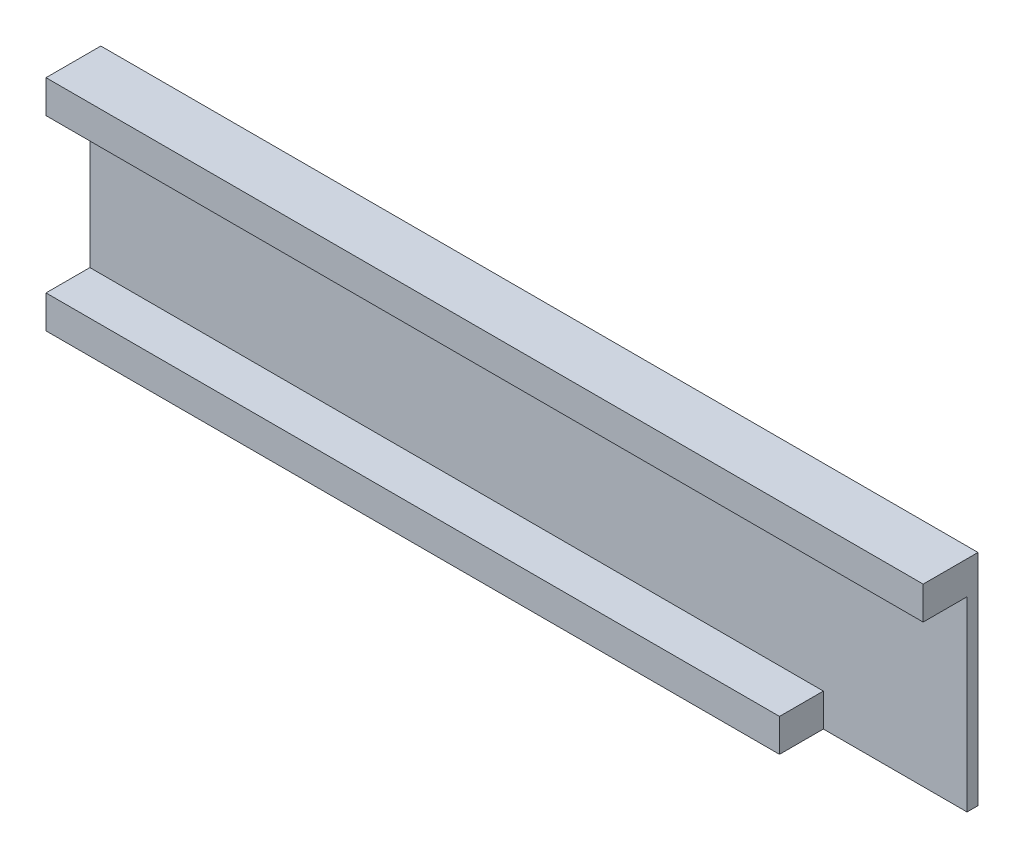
ISO-10303-21;
HEADER;
FILE_DESCRIPTION(('STEP AP214'),'2;1');
FILE_NAME('part.step','',(''),(''),'','','');
FILE_SCHEMA(('AUTOMOTIVE_DESIGN { 1 0 10303 214 1 1 1 1 }'));
ENDSEC;
DATA;
#1=APPLICATION_CONTEXT('core data for automotive mechanical design processes');
#2=APPLICATION_PROTOCOL_DEFINITION('international standard','automotive_design',2000,#1);
#3=PRODUCT_CONTEXT('',#1,'mechanical');
#4=PRODUCT('Part','Part','',(#3));
#5=PRODUCT_RELATED_PRODUCT_CATEGORY('part','',(#4));
#6=PRODUCT_DEFINITION_FORMATION('','',#4);
#7=PRODUCT_DEFINITION_CONTEXT('part definition',#1,'design');
#8=PRODUCT_DEFINITION('design','',#6,#7);
#9=PRODUCT_DEFINITION_SHAPE('','',#8);
#10=(LENGTH_UNIT() NAMED_UNIT(*) SI_UNIT(.MILLI.,.METRE.));
#11=(NAMED_UNIT(*) PLANE_ANGLE_UNIT() SI_UNIT($,.RADIAN.));
#12=(NAMED_UNIT(*) SI_UNIT($,.STERADIAN.) SOLID_ANGLE_UNIT());
#13=UNCERTAINTY_MEASURE_WITH_UNIT(LENGTH_MEASURE(1.E-05),#10,'distance_accuracy_value','');
#14=(GEOMETRIC_REPRESENTATION_CONTEXT(3) GLOBAL_UNCERTAINTY_ASSIGNED_CONTEXT((#13)) GLOBAL_UNIT_ASSIGNED_CONTEXT((#10,
#11,#12)) REPRESENTATION_CONTEXT('',''));
#15=CARTESIAN_POINT('',(0.,0.,0.));
#16=DIRECTION('',(0.,0.,1.));
#17=DIRECTION('',(1.,0.,0.));
#18=AXIS2_PLACEMENT_3D('',#15,#16,#17);
#19=CARTESIAN_POINT('',(-14.2758620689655,5.72413793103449,0.5));
#20=DIRECTION('',(1.,0.,0.));
#21=DIRECTION('',(0.,0.,-1.));
#22=AXIS2_PLACEMENT_3D('',#19,#20,#21);
#23=PLANE('',#22);
#24=DIRECTION('',(0.,0.,-1.));
#25=VECTOR('',#24,1.);
#26=CARTESIAN_POINT('',(-14.2758620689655,4.22413793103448,2.5));
#27=LINE('',#26,#25);
#28=CARTESIAN_POINT('',(-14.2758620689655,4.22413793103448,2.5));
#29=VERTEX_POINT('',#28);
#30=CARTESIAN_POINT('',(-14.2758620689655,4.22413793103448,0.5));
#31=VERTEX_POINT('',#30);
#32=EDGE_CURVE('E140',#29,#31,#27,.T.);
#33=ORIENTED_EDGE('',*,*,#32,.F.);
#34=DIRECTION('',(0.,-1.,0.));
#35=VECTOR('',#34,1.);
#36=CARTESIAN_POINT('',(-14.2758620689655,0.,2.5));
#37=LINE('',#36,#35);
#38=CARTESIAN_POINT('',(-14.2758620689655,5.72413793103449,2.5));
#39=VERTEX_POINT('',#38);
#40=EDGE_CURVE('E149',#39,#29,#37,.T.);
#41=ORIENTED_EDGE('',*,*,#40,.F.);
#42=DIRECTION('',(0.,0.,-1.));
#43=VECTOR('',#42,1.);
#44=CARTESIAN_POINT('',(-14.2758620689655,5.72413793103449,0.5));
#45=LINE('',#44,#43);
#46=CARTESIAN_POINT('',(-14.2758620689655,5.72413793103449,0.));
#47=VERTEX_POINT('',#46);
#48=EDGE_CURVE('E174',#39,#47,#45,.T.);
#49=ORIENTED_EDGE('',*,*,#48,.T.);
#50=DIRECTION('',(0.,-1.,0.));
#51=VECTOR('',#50,1.);
#52=CARTESIAN_POINT('',(-14.2758620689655,5.72413793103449,0.));
#53=LINE('',#52,#51);
#54=CARTESIAN_POINT('',(-14.2758620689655,-4.27586206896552,0.));
#55=VERTEX_POINT('',#54);
#56=EDGE_CURVE('E167',#47,#55,#53,.T.);
#57=ORIENTED_EDGE('',*,*,#56,.T.);
#58=DIRECTION('',(0.,0.,-1.));
#59=VECTOR('',#58,1.);
#60=CARTESIAN_POINT('',(-14.2758620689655,-4.27586206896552,0.5));
#61=LINE('',#60,#59);
#62=CARTESIAN_POINT('',(-14.2758620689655,-4.27586206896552,2.5));
#63=VERTEX_POINT('',#62);
#64=EDGE_CURVE('E11',#63,#55,#61,.T.);
#65=ORIENTED_EDGE('',*,*,#64,.F.);
#66=DIRECTION('',(0.,-1.,0.));
#67=VECTOR('',#66,1.);
#68=CARTESIAN_POINT('',(-14.2758620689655,0.,2.5));
#69=LINE('',#68,#67);
#70=CARTESIAN_POINT('',(-14.2758620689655,-2.77586206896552,2.5));
#71=VERTEX_POINT('',#70);
#72=EDGE_CURVE('E204',#71,#63,#69,.T.);
#73=ORIENTED_EDGE('',*,*,#72,.F.);
#74=DIRECTION('',(0.,0.,-1.));
#75=VECTOR('',#74,1.);
#76=CARTESIAN_POINT('',(-14.2758620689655,-2.77586206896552,2.5));
#77=LINE('',#76,#75);
#78=CARTESIAN_POINT('',(-14.2758620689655,-2.77586206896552,0.5));
#79=VERTEX_POINT('',#78);
#80=EDGE_CURVE('E65',#71,#79,#77,.T.);
#81=ORIENTED_EDGE('',*,*,#80,.T.);
#82=DIRECTION('',(0.,-1.,0.));
#83=VECTOR('',#82,1.);
#84=CARTESIAN_POINT('',(-14.2758620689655,5.72413793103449,0.5));
#85=LINE('',#84,#83);
#86=EDGE_CURVE('E150',#31,#79,#85,.T.);
#87=ORIENTED_EDGE('',*,*,#86,.F.);
#88=EDGE_LOOP('',(#33,#41,#49,#57,#65,#73,#81,#87));
#89=FACE_BOUND('',#88,.T.);
#90=ADVANCED_FACE('F43',(#89),#23,.F.);
#91=CARTESIAN_POINT('',(25.7241379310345,5.72413793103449,0.5));
#92=DIRECTION('',(-1.,0.,0.));
#93=DIRECTION('',(0.,0.,1.));
#94=AXIS2_PLACEMENT_3D('',#91,#92,#93);
#95=PLANE('',#94);
#96=DIRECTION('',(0.,0.,-1.));
#97=VECTOR('',#96,1.);
#98=CARTESIAN_POINT('',(25.7241379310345,4.22413793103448,2.5));
#99=LINE('',#98,#97);
#100=CARTESIAN_POINT('',(25.7241379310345,4.22413793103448,2.5));
#101=VERTEX_POINT('',#100);
#102=CARTESIAN_POINT('',(25.7241379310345,4.22413793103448,0.5));
#103=VERTEX_POINT('',#102);
#104=EDGE_CURVE('E57',#101,#103,#99,.T.);
#105=ORIENTED_EDGE('',*,*,#104,.T.);
#106=DIRECTION('',(0.,1.,0.));
#107=VECTOR('',#106,1.);
#108=CARTESIAN_POINT('',(25.7241379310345,5.72413793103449,0.5));
#109=LINE('',#108,#107);
#110=CARTESIAN_POINT('',(25.7241379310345,-4.27586206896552,0.5));
#111=VERTEX_POINT('',#110);
#112=EDGE_CURVE('E172',#111,#103,#109,.T.);
#113=ORIENTED_EDGE('',*,*,#112,.F.);
#114=DIRECTION('',(0.,0.,-1.));
#115=VECTOR('',#114,1.);
#116=CARTESIAN_POINT('',(25.7241379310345,-4.27586206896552,0.5));
#117=LINE('',#116,#115);
#118=CARTESIAN_POINT('',(25.7241379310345,-4.27586206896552,0.));
#119=VERTEX_POINT('',#118);
#120=EDGE_CURVE('E50',#111,#119,#117,.T.);
#121=ORIENTED_EDGE('',*,*,#120,.T.);
#122=DIRECTION('',(0.,1.,0.));
#123=VECTOR('',#122,1.);
#124=CARTESIAN_POINT('',(25.7241379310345,5.72413793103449,0.));
#125=LINE('',#124,#123);
#126=CARTESIAN_POINT('',(25.7241379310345,5.72413793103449,0.));
#127=VERTEX_POINT('',#126);
#128=EDGE_CURVE('E179',#119,#127,#125,.T.);
#129=ORIENTED_EDGE('',*,*,#128,.T.);
#130=DIRECTION('',(0.,0.,-1.));
#131=VECTOR('',#130,1.);
#132=CARTESIAN_POINT('',(25.7241379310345,5.72413793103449,0.5));
#133=LINE('',#132,#131);
#134=CARTESIAN_POINT('',(25.7241379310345,5.72413793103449,2.5));
#135=VERTEX_POINT('',#134);
#136=EDGE_CURVE('E183',#135,#127,#133,.T.);
#137=ORIENTED_EDGE('',*,*,#136,.F.);
#138=DIRECTION('',(0.,1.,0.));
#139=VECTOR('',#138,1.);
#140=CARTESIAN_POINT('',(25.7241379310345,0.,2.5));
#141=LINE('',#140,#139);
#142=EDGE_CURVE('E157',#101,#135,#141,.T.);
#143=ORIENTED_EDGE('',*,*,#142,.F.);
#144=EDGE_LOOP('',(#105,#113,#121,#129,#137,#143));
#145=FACE_BOUND('',#144,.T.);
#146=ADVANCED_FACE('F190',(#145),#95,.F.);
#147=CARTESIAN_POINT('',(0.,0.,2.5));
#148=DIRECTION('',(0.,0.,1.));
#149=DIRECTION('',(1.,0.,0.));
#150=AXIS2_PLACEMENT_3D('',#147,#148,#149);
#151=PLANE('',#150);
#152=ORIENTED_EDGE('',*,*,#40,.T.);
#153=DIRECTION('',(-1.,0.,0.));
#154=VECTOR('',#153,1.);
#155=CARTESIAN_POINT('',(-14.2758620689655,4.22413793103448,2.5));
#156=LINE('',#155,#154);
#157=EDGE_CURVE('E137',#101,#29,#156,.T.);
#158=ORIENTED_EDGE('',*,*,#157,.F.);
#159=ORIENTED_EDGE('',*,*,#142,.T.);
#160=DIRECTION('',(-1.,0.,0.));
#161=VECTOR('',#160,1.);
#162=CARTESIAN_POINT('',(0.,5.72413793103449,2.5));
#163=LINE('',#162,#161);
#164=EDGE_CURVE('E156',#135,#39,#163,.T.);
#165=ORIENTED_EDGE('',*,*,#164,.T.);
#166=EDGE_LOOP('',(#152,#158,#159,#165));
#167=FACE_BOUND('',#166,.T.);
#168=ADVANCED_FACE('F154',(#167),#151,.T.);
#169=CARTESIAN_POINT('',(19.1731670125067,0.,2.5));
#170=DIRECTION('',(1.,0.,0.));
#171=DIRECTION('',(0.,0.,-1.));
#172=AXIS2_PLACEMENT_3D('',#169,#170,#171);
#173=PLANE('',#172);
#174=DIRECTION('',(0.,-1.,0.));
#175=VECTOR('',#174,1.);
#176=CARTESIAN_POINT('',(19.1731670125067,0.,0.5));
#177=LINE('',#176,#175);
#178=CARTESIAN_POINT('',(19.1731670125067,-2.77586206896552,0.5));
#179=VERTEX_POINT('',#178);
#180=CARTESIAN_POINT('',(19.1731670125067,-4.27586206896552,0.5));
#181=VERTEX_POINT('',#180);
#182=EDGE_CURVE('E214',#179,#181,#177,.T.);
#183=ORIENTED_EDGE('',*,*,#182,.F.);
#184=DIRECTION('',(0.,0.,-1.));
#185=VECTOR('',#184,1.);
#186=CARTESIAN_POINT('',(19.1731670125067,-2.77586206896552,2.5));
#187=LINE('',#186,#185);
#188=CARTESIAN_POINT('',(19.1731670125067,-2.77586206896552,2.5));
#189=VERTEX_POINT('',#188);
#190=EDGE_CURVE('E262',#189,#179,#187,.T.);
#191=ORIENTED_EDGE('',*,*,#190,.F.);
#192=DIRECTION('',(0.,-1.,0.));
#193=VECTOR('',#192,1.);
#194=CARTESIAN_POINT('',(19.1731670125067,0.,2.5));
#195=LINE('',#194,#193);
#196=CARTESIAN_POINT('',(19.1731670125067,-4.27586206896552,2.5));
#197=VERTEX_POINT('',#196);
#198=EDGE_CURVE('E211',#189,#197,#195,.T.);
#199=ORIENTED_EDGE('',*,*,#198,.T.);
#200=DIRECTION('',(0.,0.,-1.));
#201=VECTOR('',#200,1.);
#202=CARTESIAN_POINT('',(19.1731670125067,-4.27586206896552,2.5));
#203=LINE('',#202,#201);
#204=EDGE_CURVE('E158',#197,#181,#203,.T.);
#205=ORIENTED_EDGE('',*,*,#204,.T.);
#206=EDGE_LOOP('',(#183,#191,#199,#205));
#207=FACE_BOUND('',#206,.T.);
#208=ADVANCED_FACE('F270',(#207),#173,.T.);
#209=CARTESIAN_POINT('',(0.,0.,2.5));
#210=DIRECTION('',(0.,0.,1.));
#211=DIRECTION('',(1.,0.,0.));
#212=AXIS2_PLACEMENT_3D('',#209,#210,#211);
#213=PLANE('',#212);
#214=ORIENTED_EDGE('',*,*,#198,.F.);
#215=DIRECTION('',(1.,0.,0.));
#216=VECTOR('',#215,1.);
#217=CARTESIAN_POINT('',(-14.2758620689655,-2.77586206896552,2.5));
#218=LINE('',#217,#216);
#219=EDGE_CURVE('E259',#71,#189,#218,.T.);
#220=ORIENTED_EDGE('',*,*,#219,.F.);
#221=ORIENTED_EDGE('',*,*,#72,.T.);
#222=DIRECTION('',(1.,0.,0.));
#223=VECTOR('',#222,1.);
#224=CARTESIAN_POINT('',(0.,-4.27586206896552,2.5));
#225=LINE('',#224,#223);
#226=EDGE_CURVE('E162',#63,#197,#225,.T.);
#227=ORIENTED_EDGE('',*,*,#226,.T.);
#228=EDGE_LOOP('',(#214,#220,#221,#227));
#229=FACE_BOUND('',#228,.T.);
#230=ADVANCED_FACE('F272',(#229),#213,.T.);
#231=CARTESIAN_POINT('',(0.,0.,0.));
#232=DIRECTION('',(0.,0.,1.));
#233=DIRECTION('',(1.,0.,0.));
#234=AXIS2_PLACEMENT_3D('',#231,#232,#233);
#235=PLANE('',#234);
#236=ORIENTED_EDGE('',*,*,#56,.F.);
#237=DIRECTION('',(-1.,0.,0.));
#238=VECTOR('',#237,1.);
#239=CARTESIAN_POINT('',(-14.2758620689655,5.72413793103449,0.));
#240=LINE('',#239,#238);
#241=EDGE_CURVE('E170',#127,#47,#240,.T.);
#242=ORIENTED_EDGE('',*,*,#241,.F.);
#243=ORIENTED_EDGE('',*,*,#128,.F.);
#244=DIRECTION('',(1.,0.,0.));
#245=VECTOR('',#244,1.);
#246=CARTESIAN_POINT('',(-14.2758620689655,-4.27586206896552,0.));
#247=LINE('',#246,#245);
#248=EDGE_CURVE('E177',#55,#119,#247,.T.);
#249=ORIENTED_EDGE('',*,*,#248,.F.);
#250=EDGE_LOOP('',(#236,#242,#243,#249));
#251=FACE_BOUND('',#250,.T.);
#252=DIRECTION('',(-0.894309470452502,0.447448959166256,0.));
#253=VECTOR('',#252,1.);
#254=CARTESIAN_POINT('',(-7.73191451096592,0.371602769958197,0.));
#255=LINE('',#254,#253);
#256=CARTESIAN_POINT('',(-7.73191451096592,0.371602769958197,0.));
#257=VERTEX_POINT('',#256);
#258=CARTESIAN_POINT('',(-11.678686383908,2.34628717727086,0.));
#259=VERTEX_POINT('',#258);
#260=EDGE_CURVE('E233',#257,#259,#255,.T.);
#261=ORIENTED_EDGE('',*,*,#260,.F.);
#262=DIRECTION('',(-0.999986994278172,0.00510012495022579,0.));
#263=VECTOR('',#262,1.);
#264=CARTESIAN_POINT('',(23.2315207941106,0.21368332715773,0.));
#265=LINE('',#264,#263);
#266=CARTESIAN_POINT('',(23.2315207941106,0.213683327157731,0.));
#267=VERTEX_POINT('',#266);
#268=EDGE_CURVE('E237',#267,#257,#265,.T.);
#269=ORIENTED_EDGE('',*,*,#268,.F.);
#270=DIRECTION('',(0.894309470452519,-0.447448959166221,0.));
#271=VECTOR('',#270,1.);
#272=CARTESIAN_POINT('',(18.9691177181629,2.34628717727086,0.));
#273=LINE('',#272,#271);
#274=CARTESIAN_POINT('',(18.9691177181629,2.34628717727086,0.));
#275=VERTEX_POINT('',#274);
#276=EDGE_CURVE('E241',#275,#267,#273,.T.);
#277=ORIENTED_EDGE('',*,*,#276,.F.);
#278=DIRECTION('',(1.,0.,0.));
#279=VECTOR('',#278,1.);
#280=CARTESIAN_POINT('',(-11.678686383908,2.34628717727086,0.));
#281=LINE('',#280,#279);
#282=EDGE_CURVE('E254',#259,#275,#281,.T.);
#283=ORIENTED_EDGE('',*,*,#282,.F.);
#284=EDGE_LOOP('',(#261,#269,#277,#283));
#285=FACE_BOUND('',#284,.T.);
#286=ADVANCED_FACE('F197',(#251,#285),#235,.F.);
#287=CARTESIAN_POINT('',(-14.2758620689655,-4.27586206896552,0.5));
#288=DIRECTION('',(0.,1.,0.));
#289=DIRECTION('',(-1.,0.,0.));
#290=AXIS2_PLACEMENT_3D('',#287,#288,#289);
#291=PLANE('',#290);
#292=ORIENTED_EDGE('',*,*,#248,.T.);
#293=ORIENTED_EDGE('',*,*,#120,.F.);
#294=DIRECTION('',(1.,0.,0.));
#295=VECTOR('',#294,1.);
#296=CARTESIAN_POINT('',(-14.2758620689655,-4.27586206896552,0.5));
#297=LINE('',#296,#295);
#298=EDGE_CURVE('E169',#181,#111,#297,.T.);
#299=ORIENTED_EDGE('',*,*,#298,.F.);
#300=ORIENTED_EDGE('',*,*,#204,.F.);
#301=ORIENTED_EDGE('',*,*,#226,.F.);
#302=ORIENTED_EDGE('',*,*,#64,.T.);
#303=EDGE_LOOP('',(#292,#293,#299,#300,#301,#302));
#304=FACE_BOUND('',#303,.T.);
#305=ADVANCED_FACE('F207',(#304),#291,.F.);
#306=CARTESIAN_POINT('',(-14.2758620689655,5.72413793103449,0.5));
#307=DIRECTION('',(0.,-1.,0.));
#308=DIRECTION('',(0.,0.,-1.));
#309=AXIS2_PLACEMENT_3D('',#306,#307,#308);
#310=PLANE('',#309);
#311=ORIENTED_EDGE('',*,*,#241,.T.);
#312=ORIENTED_EDGE('',*,*,#48,.F.);
#313=ORIENTED_EDGE('',*,*,#164,.F.);
#314=ORIENTED_EDGE('',*,*,#136,.T.);
#315=EDGE_LOOP('',(#311,#312,#313,#314));
#316=FACE_BOUND('',#315,.T.);
#317=ADVANCED_FACE('F200',(#316),#310,.F.);
#318=CARTESIAN_POINT('',(0.,0.,0.5));
#319=DIRECTION('',(0.,0.,1.));
#320=DIRECTION('',(1.,0.,0.));
#321=AXIS2_PLACEMENT_3D('',#318,#319,#320);
#322=PLANE('',#321);
#323=DIRECTION('',(1.,0.,0.));
#324=VECTOR('',#323,1.);
#325=CARTESIAN_POINT('',(-14.2758620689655,-2.77586206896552,0.5));
#326=LINE('',#325,#324);
#327=EDGE_CURVE('E261',#79,#179,#326,.T.);
#328=ORIENTED_EDGE('',*,*,#327,.T.);
#329=ORIENTED_EDGE('',*,*,#182,.T.);
#330=ORIENTED_EDGE('',*,*,#298,.T.);
#331=ORIENTED_EDGE('',*,*,#112,.T.);
#332=DIRECTION('',(-1.,0.,0.));
#333=VECTOR('',#332,1.);
#334=CARTESIAN_POINT('',(-14.2758620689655,4.22413793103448,0.5));
#335=LINE('',#334,#333);
#336=EDGE_CURVE('E144',#103,#31,#335,.T.);
#337=ORIENTED_EDGE('',*,*,#336,.T.);
#338=ORIENTED_EDGE('',*,*,#86,.T.);
#339=EDGE_LOOP('',(#328,#329,#330,#331,#337,#338));
#340=FACE_BOUND('',#339,.T.);
#341=ADVANCED_FACE('F268',(#340),#322,.T.);
#342=CARTESIAN_POINT('',(-11.678686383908,2.34628717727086,0.));
#343=DIRECTION('',(0.,1.,0.));
#344=DIRECTION('',(0.,0.,1.));
#345=AXIS2_PLACEMENT_3D('',#342,#343,#344);
#346=PLANE('',#345);
#347=DIRECTION('',(1.,0.,0.));
#348=VECTOR('',#347,1.);
#349=CARTESIAN_POINT('',(-11.678686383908,2.34628717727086,-1.47540173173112));
#350=LINE('',#349,#348);
#351=CARTESIAN_POINT('',(-11.678686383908,2.34628717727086,-1.47540173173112));
#352=VERTEX_POINT('',#351);
#353=CARTESIAN_POINT('',(18.9691177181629,2.34628717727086,-1.47540173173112));
#354=VERTEX_POINT('',#353);
#355=EDGE_CURVE('E245',#352,#354,#350,.T.);
#356=ORIENTED_EDGE('',*,*,#355,.F.);
#357=DIRECTION('',(0.,0.,-1.));
#358=VECTOR('',#357,1.);
#359=CARTESIAN_POINT('',(-11.678686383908,2.34628717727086,0.));
#360=LINE('',#359,#358);
#361=EDGE_CURVE('E215',#259,#352,#360,.T.);
#362=ORIENTED_EDGE('',*,*,#361,.F.);
#363=ORIENTED_EDGE('',*,*,#282,.T.);
#364=DIRECTION('',(0.,0.,-1.));
#365=VECTOR('',#364,1.);
#366=CARTESIAN_POINT('',(18.9691177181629,2.34628717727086,0.));
#367=LINE('',#366,#365);
#368=EDGE_CURVE('E232',#275,#354,#367,.T.);
#369=ORIENTED_EDGE('',*,*,#368,.T.);
#370=EDGE_LOOP('',(#356,#362,#363,#369));
#371=FACE_BOUND('',#370,.T.);
#372=ADVANCED_FACE('F308',(#371),#346,.T.);
#373=CARTESIAN_POINT('',(-7.73191451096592,0.371602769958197,0.));
#374=DIRECTION('',(-0.447448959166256,-0.894309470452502,0.));
#375=DIRECTION('',(0.894309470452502,-0.447448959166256,0.));
#376=AXIS2_PLACEMENT_3D('',#373,#374,#375);
#377=PLANE('',#376);
#378=DIRECTION('',(-0.894309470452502,0.447448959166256,0.));
#379=VECTOR('',#378,1.);
#380=CARTESIAN_POINT('',(-7.73191451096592,0.371602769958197,-1.47540173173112));
#381=LINE('',#380,#379);
#382=CARTESIAN_POINT('',(-7.73191451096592,0.371602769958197,-1.47540173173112));
#383=VERTEX_POINT('',#382);
#384=EDGE_CURVE('E227',#383,#352,#381,.T.);
#385=ORIENTED_EDGE('',*,*,#384,.F.);
#386=DIRECTION('',(0.,0.,-1.));
#387=VECTOR('',#386,1.);
#388=CARTESIAN_POINT('',(-7.73191451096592,0.371602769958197,0.));
#389=LINE('',#388,#387);
#390=EDGE_CURVE('E218',#257,#383,#389,.T.);
#391=ORIENTED_EDGE('',*,*,#390,.F.);
#392=ORIENTED_EDGE('',*,*,#260,.T.);
#393=ORIENTED_EDGE('',*,*,#361,.T.);
#394=EDGE_LOOP('',(#385,#391,#392,#393));
#395=FACE_BOUND('',#394,.T.);
#396=ADVANCED_FACE('F313',(#395),#377,.T.);
#397=CARTESIAN_POINT('',(23.2315207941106,0.21368332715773,0.));
#398=DIRECTION('',(-0.00510012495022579,-0.999986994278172,0.));
#399=DIRECTION('',(0.999986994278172,-0.00510012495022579,0.));
#400=AXIS2_PLACEMENT_3D('',#397,#398,#399);
#401=PLANE('',#400);
#402=DIRECTION('',(-0.999986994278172,0.00510012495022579,0.));
#403=VECTOR('',#402,1.);
#404=CARTESIAN_POINT('',(23.2315207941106,0.21368332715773,-1.47540173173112));
#405=LINE('',#404,#403);
#406=CARTESIAN_POINT('',(23.2315207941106,0.213683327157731,-1.47540173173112));
#407=VERTEX_POINT('',#406);
#408=EDGE_CURVE('E250',#407,#383,#405,.T.);
#409=ORIENTED_EDGE('',*,*,#408,.F.);
#410=DIRECTION('',(0.,0.,-1.));
#411=VECTOR('',#410,1.);
#412=CARTESIAN_POINT('',(23.2315207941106,0.21368332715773,0.));
#413=LINE('',#412,#411);
#414=EDGE_CURVE('E224',#267,#407,#413,.T.);
#415=ORIENTED_EDGE('',*,*,#414,.F.);
#416=ORIENTED_EDGE('',*,*,#268,.T.);
#417=ORIENTED_EDGE('',*,*,#390,.T.);
#418=EDGE_LOOP('',(#409,#415,#416,#417));
#419=FACE_BOUND('',#418,.T.);
#420=ADVANCED_FACE('F316',(#419),#401,.T.);
#421=CARTESIAN_POINT('',(18.9691177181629,2.34628717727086,0.));
#422=DIRECTION('',(0.447448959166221,0.894309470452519,0.));
#423=DIRECTION('',(-0.894309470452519,0.447448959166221,0.));
#424=AXIS2_PLACEMENT_3D('',#421,#422,#423);
#425=PLANE('',#424);
#426=DIRECTION('',(0.894309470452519,-0.447448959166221,0.));
#427=VECTOR('',#426,1.);
#428=CARTESIAN_POINT('',(18.9691177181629,2.34628717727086,-1.47540173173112));
#429=LINE('',#428,#427);
#430=EDGE_CURVE('E248',#354,#407,#429,.T.);
#431=ORIENTED_EDGE('',*,*,#430,.F.);
#432=ORIENTED_EDGE('',*,*,#368,.F.);
#433=ORIENTED_EDGE('',*,*,#276,.T.);
#434=ORIENTED_EDGE('',*,*,#414,.T.);
#435=EDGE_LOOP('',(#431,#432,#433,#434));
#436=FACE_BOUND('',#435,.T.);
#437=ADVANCED_FACE('F283',(#436),#425,.T.);
#438=CARTESIAN_POINT('',(0.,0.,-1.47540173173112));
#439=DIRECTION('',(0.,0.,1.));
#440=DIRECTION('',(1.,0.,0.));
#441=AXIS2_PLACEMENT_3D('',#438,#439,#440);
#442=PLANE('',#441);
#443=ORIENTED_EDGE('',*,*,#355,.T.);
#444=ORIENTED_EDGE('',*,*,#430,.T.);
#445=ORIENTED_EDGE('',*,*,#408,.T.);
#446=ORIENTED_EDGE('',*,*,#384,.T.);
#447=EDGE_LOOP('',(#443,#444,#445,#446));
#448=FACE_BOUND('',#447,.T.);
#449=ADVANCED_FACE('F275',(#448),#442,.F.);
#450=CARTESIAN_POINT('',(-14.2758620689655,-2.77586206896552,2.5));
#451=DIRECTION('',(0.,1.,0.));
#452=DIRECTION('',(0.,0.,1.));
#453=AXIS2_PLACEMENT_3D('',#450,#451,#452);
#454=PLANE('',#453);
#455=ORIENTED_EDGE('',*,*,#327,.F.);
#456=ORIENTED_EDGE('',*,*,#80,.F.);
#457=ORIENTED_EDGE('',*,*,#219,.T.);
#458=ORIENTED_EDGE('',*,*,#190,.T.);
#459=EDGE_LOOP('',(#455,#456,#457,#458));
#460=FACE_BOUND('',#459,.T.);
#461=ADVANCED_FACE('F273',(#460),#454,.T.);
#462=CARTESIAN_POINT('',(-14.2758620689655,4.22413793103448,2.5));
#463=DIRECTION('',(0.,-1.,0.));
#464=DIRECTION('',(0.,0.,-1.));
#465=AXIS2_PLACEMENT_3D('',#462,#463,#464);
#466=PLANE('',#465);
#467=ORIENTED_EDGE('',*,*,#336,.F.);
#468=ORIENTED_EDGE('',*,*,#104,.F.);
#469=ORIENTED_EDGE('',*,*,#157,.T.);
#470=ORIENTED_EDGE('',*,*,#32,.T.);
#471=EDGE_LOOP('',(#467,#468,#469,#470));
#472=FACE_BOUND('',#471,.T.);
#473=ADVANCED_FACE('F139',(#472),#466,.T.);
#474=CLOSED_SHELL('',(#90,#146,#168,#208,#230,#286,#305,#317,#341,#372,#396,#420,#437,#449,#461,#473));
#475=MANIFOLD_SOLID_BREP('B2',#474);
#476=ADVANCED_BREP_SHAPE_REPRESENTATION('',(#18,#475),#14);
#477=SHAPE_DEFINITION_REPRESENTATION(#9,#476);
ENDSEC;
END-ISO-10303-21;
